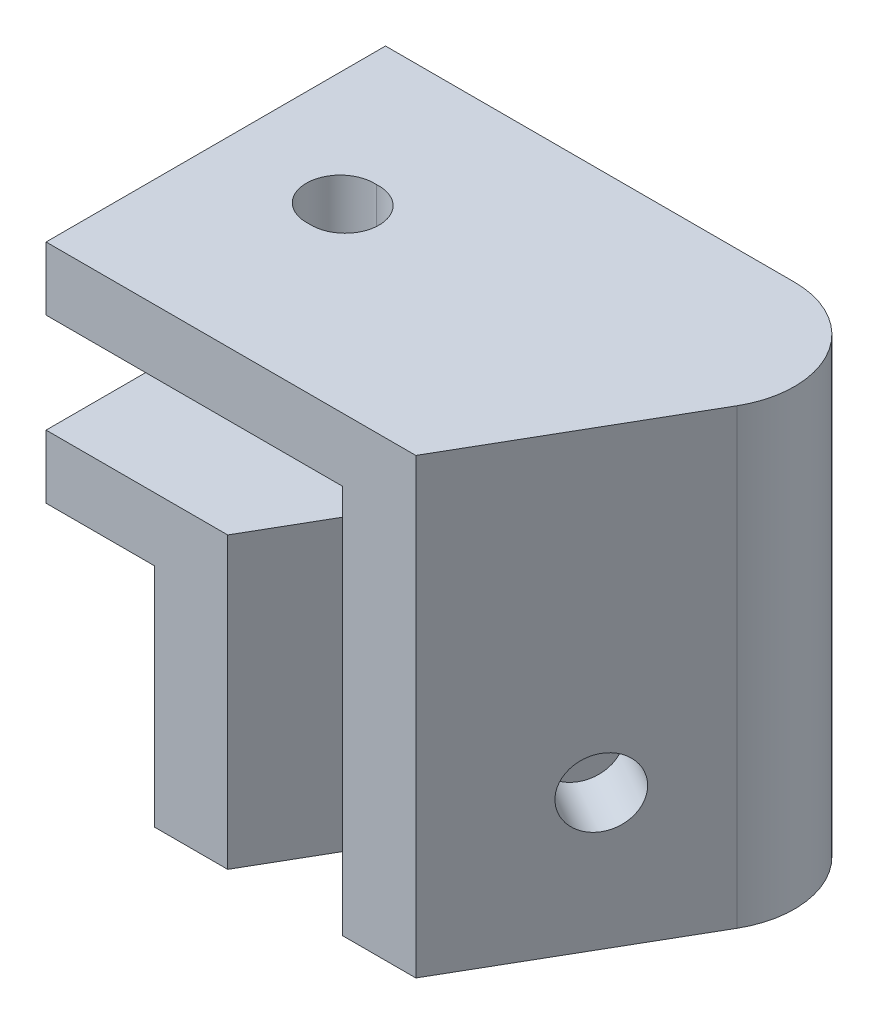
ISO-10303-21;
HEADER;
FILE_DESCRIPTION(('STEP AP214'),'2;1');
FILE_NAME('part.step','',(''),(''),'','','');
FILE_SCHEMA(('AUTOMOTIVE_DESIGN { 1 0 10303 214 1 1 1 1 }'));
ENDSEC;
DATA;
#1=APPLICATION_CONTEXT('core data for automotive mechanical design processes');
#2=APPLICATION_PROTOCOL_DEFINITION('international standard','automotive_design',2000,#1);
#3=PRODUCT_CONTEXT('',#1,'mechanical');
#4=PRODUCT('Part','Part','',(#3));
#5=PRODUCT_RELATED_PRODUCT_CATEGORY('part','',(#4));
#6=PRODUCT_DEFINITION_FORMATION('','',#4);
#7=PRODUCT_DEFINITION_CONTEXT('part definition',#1,'design');
#8=PRODUCT_DEFINITION('design','',#6,#7);
#9=PRODUCT_DEFINITION_SHAPE('','',#8);
#10=(LENGTH_UNIT() NAMED_UNIT(*) SI_UNIT(.MILLI.,.METRE.));
#11=(NAMED_UNIT(*) PLANE_ANGLE_UNIT() SI_UNIT($,.RADIAN.));
#12=(NAMED_UNIT(*) SI_UNIT($,.STERADIAN.) SOLID_ANGLE_UNIT());
#13=UNCERTAINTY_MEASURE_WITH_UNIT(LENGTH_MEASURE(1.E-05),#10,'distance_accuracy_value','');
#14=(GEOMETRIC_REPRESENTATION_CONTEXT(3) GLOBAL_UNCERTAINTY_ASSIGNED_CONTEXT((#13)) GLOBAL_UNIT_ASSIGNED_CONTEXT((#10,
#11,#12)) REPRESENTATION_CONTEXT('',''));
#15=CARTESIAN_POINT('',(0.,0.,0.));
#16=DIRECTION('',(0.,0.,1.));
#17=DIRECTION('',(1.,0.,0.));
#18=AXIS2_PLACEMENT_3D('',#15,#16,#17);
#19=CARTESIAN_POINT('',(7.53478768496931,-3.,-4.5));
#20=DIRECTION('',(0.,0.,-1.));
#21=DIRECTION('',(-1.,0.,0.));
#22=AXIS2_PLACEMENT_3D('',#19,#20,#21);
#23=PLANE('',#22);
#24=DIRECTION('',(1.,0.,0.));
#25=VECTOR('',#24,1.);
#26=CARTESIAN_POINT('',(7.53478768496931,-7.2,-4.5));
#27=LINE('',#26,#25);
#28=CARTESIAN_POINT('',(2.45410531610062,-7.2,-4.5));
#29=VERTEX_POINT('',#28);
#30=CARTESIAN_POINT('',(7.53478768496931,-7.2,-4.5));
#31=VERTEX_POINT('',#30);
#32=EDGE_CURVE('E195',#29,#31,#27,.T.);
#33=ORIENTED_EDGE('',*,*,#32,.T.);
#34=DIRECTION('',(0.,-1.,0.));
#35=VECTOR('',#34,1.);
#36=CARTESIAN_POINT('',(7.53478768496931,-3.,-4.5));
#37=LINE('',#36,#35);
#38=CARTESIAN_POINT('',(7.53478768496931,-2.8,-4.5));
#39=VERTEX_POINT('',#38);
#40=EDGE_CURVE('E230',#39,#31,#37,.T.);
#41=ORIENTED_EDGE('',*,*,#40,.F.);
#42=DIRECTION('',(-1.,0.,0.));
#43=VECTOR('',#42,1.);
#44=CARTESIAN_POINT('',(17.8405543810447,-2.8,-4.5));
#45=LINE('',#44,#43);
#46=CARTESIAN_POINT('',(-12.5,-2.8,-4.5));
#47=VERTEX_POINT('',#46);
#48=EDGE_CURVE('E216',#39,#47,#45,.T.);
#49=ORIENTED_EDGE('',*,*,#48,.T.);
#50=DIRECTION('',(0.,1.,0.));
#51=VECTOR('',#50,1.);
#52=CARTESIAN_POINT('',(-12.5,-7.2,-4.5));
#53=LINE('',#52,#51);
#54=CARTESIAN_POINT('',(-12.5,-7.2,-4.5));
#55=VERTEX_POINT('',#54);
#56=EDGE_CURVE('E209',#55,#47,#53,.T.);
#57=ORIENTED_EDGE('',*,*,#56,.F.);
#58=DIRECTION('',(-1.,0.,0.));
#59=VECTOR('',#58,1.);
#60=CARTESIAN_POINT('',(17.8405543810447,-7.2,-4.5));
#61=LINE('',#60,#59);
#62=EDGE_CURVE('E208',#29,#55,#61,.T.);
#63=ORIENTED_EDGE('',*,*,#62,.F.);
#64=EDGE_LOOP('',(#33,#41,#49,#57,#63));
#65=FACE_BOUND('',#64,.T.);
#66=ADVANCED_FACE('F34',(#65),#23,.F.);
#67=CARTESIAN_POINT('',(-12.5,-10.,7.5));
#68=DIRECTION('',(0.,0.,-1.));
#69=DIRECTION('',(-1.,0.,0.));
#70=AXIS2_PLACEMENT_3D('',#67,#68,#69);
#71=PLANE('',#70);
#72=DIRECTION('',(0.,1.,0.));
#73=VECTOR('',#72,1.);
#74=CARTESIAN_POINT('',(-12.5,-10.,7.5));
#75=LINE('',#74,#73);
#76=CARTESIAN_POINT('',(-12.5,-10.,7.5));
#77=VERTEX_POINT('',#76);
#78=CARTESIAN_POINT('',(-12.5,-7.2,7.5));
#79=VERTEX_POINT('',#78);
#80=EDGE_CURVE('E281',#77,#79,#75,.T.);
#81=ORIENTED_EDGE('',*,*,#80,.F.);
#82=DIRECTION('',(1.,0.,0.));
#83=VECTOR('',#82,1.);
#84=CARTESIAN_POINT('',(-12.5,-10.,7.5));
#85=LINE('',#84,#83);
#86=CARTESIAN_POINT('',(-7.70725942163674,-10.,7.5));
#87=VERTEX_POINT('',#86);
#88=EDGE_CURVE('E270',#77,#87,#85,.T.);
#89=ORIENTED_EDGE('',*,*,#88,.T.);
#90=DIRECTION('',(0.,1.,0.));
#91=VECTOR('',#90,1.);
#92=CARTESIAN_POINT('',(-7.70725942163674,-20.,7.5));
#93=LINE('',#92,#91);
#94=CARTESIAN_POINT('',(-7.70725942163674,-20.,7.5));
#95=VERTEX_POINT('',#94);
#96=EDGE_CURVE('E258',#95,#87,#93,.T.);
#97=ORIENTED_EDGE('',*,*,#96,.F.);
#98=DIRECTION('',(1.,0.,0.));
#99=VECTOR('',#98,1.);
#100=CARTESIAN_POINT('',(3.83974596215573,-20.,7.5));
#101=LINE('',#100,#99);
#102=CARTESIAN_POINT('',(-4.47409791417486,-20.,7.5));
#103=VERTEX_POINT('',#102);
#104=EDGE_CURVE('E248',#95,#103,#101,.T.);
#105=ORIENTED_EDGE('',*,*,#104,.T.);
#106=DIRECTION('',(0.,-1.,0.));
#107=VECTOR('',#106,1.);
#108=CARTESIAN_POINT('',(-4.47409791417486,-10.,7.5));
#109=LINE('',#108,#107);
#110=CARTESIAN_POINT('',(-4.47409791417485,-7.2,7.5));
#111=VERTEX_POINT('',#110);
#112=EDGE_CURVE('E238',#111,#103,#109,.T.);
#113=ORIENTED_EDGE('',*,*,#112,.F.);
#114=DIRECTION('',(-1.,0.,0.));
#115=VECTOR('',#114,1.);
#116=CARTESIAN_POINT('',(17.8405543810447,-7.2,7.5));
#117=LINE('',#116,#115);
#118=EDGE_CURVE('E218',#111,#79,#117,.T.);
#119=ORIENTED_EDGE('',*,*,#118,.T.);
#120=EDGE_LOOP('',(#81,#89,#97,#105,#113,#119));
#121=FACE_BOUND('',#120,.T.);
#122=ADVANCED_FACE('F340',(#121),#71,.F.);
#123=CARTESIAN_POINT('',(0.,-10.,0.));
#124=DIRECTION('',(0.,1.,0.));
#125=DIRECTION('',(0.,0.,-1.));
#126=AXIS2_PLACEMENT_3D('',#123,#124,#125);
#127=PLANE('',#126);
#128=CARTESIAN_POINT('',(-7.50000000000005,-10.,-0.499999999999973));
#129=DIRECTION('',(0.,-1.,0.));
#130=DIRECTION('',(0.,0.,-1.));
#131=AXIS2_PLACEMENT_3D('',#128,#129,#130);
#132=CIRCLE('',#131,1.49999999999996);
#133=CARTESIAN_POINT('',(-7.3931817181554,-10.,0.996191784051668));
#134=VERTEX_POINT('',#133);
#135=CARTESIAN_POINT('',(-7.39318171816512,-10.,-1.99619178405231));
#136=VERTEX_POINT('',#135);
#137=EDGE_CURVE('E188',#134,#136,#132,.T.);
#138=ORIENTED_EDGE('',*,*,#137,.F.);
#139=CARTESIAN_POINT('',(-7.28636343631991,-10.,-0.500000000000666));
#140=DIRECTION('',(0.,1.,0.));
#141=DIRECTION('',(0.,0.,1.));
#142=AXIS2_PLACEMENT_3D('',#139,#140,#141);
#143=CIRCLE('',#142,1.5);
#144=EDGE_CURVE('E57',#134,#136,#143,.T.);
#145=ORIENTED_EDGE('',*,*,#144,.T.);
#146=EDGE_LOOP('',(#138,#145));
#147=FACE_BOUND('',#146,.T.);
#148=DIRECTION('',(-0.499999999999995,0.,0.866025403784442));
#149=VECTOR('',#148,1.);
#150=CARTESIAN_POINT('',(0.952994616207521,-10.,-7.5));
#151=LINE('',#150,#149);
#152=CARTESIAN_POINT('',(0.95299461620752,-10.,-7.5));
#153=VERTEX_POINT('',#152);
#154=EDGE_CURVE('E241',#153,#87,#151,.T.);
#155=ORIENTED_EDGE('',*,*,#154,.T.);
#156=ORIENTED_EDGE('',*,*,#88,.F.);
#157=DIRECTION('',(0.,0.,1.));
#158=VECTOR('',#157,1.);
#159=CARTESIAN_POINT('',(-12.5,-10.,7.5));
#160=LINE('',#159,#158);
#161=CARTESIAN_POINT('',(-12.5,-10.,-7.5));
#162=VERTEX_POINT('',#161);
#163=EDGE_CURVE('E267',#162,#77,#160,.T.);
#164=ORIENTED_EDGE('',*,*,#163,.F.);
#165=DIRECTION('',(-1.,0.,0.));
#166=VECTOR('',#165,1.);
#167=CARTESIAN_POINT('',(-12.5,-10.,-7.5));
#168=LINE('',#167,#166);
#169=EDGE_CURVE('E264',#153,#162,#168,.T.);
#170=ORIENTED_EDGE('',*,*,#169,.F.);
#171=EDGE_LOOP('',(#155,#156,#164,#170));
#172=FACE_BOUND('',#171,.T.);
#173=ADVANCED_FACE('F311',(#147,#172),#127,.F.);
#174=CARTESIAN_POINT('',(-12.5,-10.,-7.5));
#175=DIRECTION('',(0.,0.,1.));
#176=DIRECTION('',(1.,0.,0.));
#177=AXIS2_PLACEMENT_3D('',#174,#175,#176);
#178=PLANE('',#177);
#179=DIRECTION('',(-1.,0.,0.));
#180=VECTOR('',#179,1.);
#181=CARTESIAN_POINT('',(0.952994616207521,-20.,-7.5));
#182=LINE('',#181,#180);
#183=CARTESIAN_POINT('',(5.57179676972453,-20.,-7.5));
#184=VERTEX_POINT('',#183);
#185=CARTESIAN_POINT('',(0.952994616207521,-20.,-7.5));
#186=VERTEX_POINT('',#185);
#187=EDGE_CURVE('E242',#184,#186,#182,.T.);
#188=ORIENTED_EDGE('',*,*,#187,.T.);
#189=DIRECTION('',(0.,1.,0.));
#190=VECTOR('',#189,1.);
#191=CARTESIAN_POINT('',(0.952994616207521,-20.,-7.5));
#192=LINE('',#191,#190);
#193=EDGE_CURVE('E261',#186,#153,#192,.T.);
#194=ORIENTED_EDGE('',*,*,#193,.T.);
#195=ORIENTED_EDGE('',*,*,#169,.T.);
#196=DIRECTION('',(0.,1.,0.));
#197=VECTOR('',#196,1.);
#198=CARTESIAN_POINT('',(-12.5,-10.,-7.5));
#199=LINE('',#198,#197);
#200=CARTESIAN_POINT('',(-12.5,0.,-7.5));
#201=VERTEX_POINT('',#200);
#202=EDGE_CURVE('E284',#162,#201,#199,.T.);
#203=ORIENTED_EDGE('',*,*,#202,.T.);
#204=DIRECTION('',(-1.,0.,0.));
#205=VECTOR('',#204,1.);
#206=CARTESIAN_POINT('',(-12.5,0.,-7.5));
#207=LINE('',#206,#205);
#208=CARTESIAN_POINT('',(5.57179676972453,0.,-7.5));
#209=VERTEX_POINT('',#208);
#210=EDGE_CURVE('E263',#209,#201,#207,.T.);
#211=ORIENTED_EDGE('',*,*,#210,.F.);
#212=DIRECTION('',(0.,1.,0.));
#213=VECTOR('',#212,1.);
#214=CARTESIAN_POINT('',(5.57179676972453,-10.,-7.5));
#215=LINE('',#214,#213);
#216=EDGE_CURVE('E292',#184,#209,#215,.T.);
#217=ORIENTED_EDGE('',*,*,#216,.F.);
#218=EDGE_LOOP('',(#188,#194,#195,#203,#211,#217));
#219=FACE_BOUND('',#218,.T.);
#220=ADVANCED_FACE('F375',(#219),#178,.F.);
#221=CARTESIAN_POINT('',(-12.5,-10.,7.5));
#222=DIRECTION('',(1.,0.,0.));
#223=DIRECTION('',(0.,0.,-1.));
#224=AXIS2_PLACEMENT_3D('',#221,#222,#223);
#225=PLANE('',#224);
#226=ORIENTED_EDGE('',*,*,#56,.T.);
#227=DIRECTION('',(0.,0.,1.));
#228=VECTOR('',#227,1.);
#229=CARTESIAN_POINT('',(-12.5,-2.8,7.5));
#230=LINE('',#229,#228);
#231=CARTESIAN_POINT('',(-12.5,-2.8,7.5));
#232=VERTEX_POINT('',#231);
#233=EDGE_CURVE('E205',#47,#232,#230,.T.);
#234=ORIENTED_EDGE('',*,*,#233,.T.);
#235=CARTESIAN_POINT('',(-12.5,0.,7.5));
#236=VERTEX_POINT('',#235);
#237=EDGE_CURVE('E273',#232,#236,#75,.T.);
#238=ORIENTED_EDGE('',*,*,#237,.T.);
#239=DIRECTION('',(0.,0.,1.));
#240=VECTOR('',#239,1.);
#241=CARTESIAN_POINT('',(-12.5,0.,7.5));
#242=LINE('',#241,#240);
#243=EDGE_CURVE('E276',#201,#236,#242,.T.);
#244=ORIENTED_EDGE('',*,*,#243,.F.);
#245=ORIENTED_EDGE('',*,*,#202,.F.);
#246=ORIENTED_EDGE('',*,*,#163,.T.);
#247=ORIENTED_EDGE('',*,*,#80,.T.);
#248=DIRECTION('',(0.,0.,-1.));
#249=VECTOR('',#248,1.);
#250=CARTESIAN_POINT('',(-12.5,-7.2,7.5));
#251=LINE('',#250,#249);
#252=EDGE_CURVE('E204',#79,#55,#251,.T.);
#253=ORIENTED_EDGE('',*,*,#252,.T.);
#254=EDGE_LOOP('',(#226,#234,#238,#244,#245,#246,#247,#253));
#255=FACE_BOUND('',#254,.T.);
#256=ADVANCED_FACE('F365',(#255),#225,.F.);
#257=DIRECTION('',(0.,1.,0.));
#258=VECTOR('',#257,1.);
#259=CARTESIAN_POINT('',(0.606584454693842,-10.,7.5));
#260=LINE('',#259,#258);
#261=CARTESIAN_POINT('',(0.606584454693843,-20.,7.5));
#262=VERTEX_POINT('',#261);
#263=CARTESIAN_POINT('',(0.606584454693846,-2.8,7.5));
#264=VERTEX_POINT('',#263);
#265=EDGE_CURVE('E233',#262,#264,#260,.T.);
#266=ORIENTED_EDGE('',*,*,#265,.F.);
#267=CARTESIAN_POINT('',(3.83974596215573,-20.,7.5));
#268=VERTEX_POINT('',#267);
#269=EDGE_CURVE('E247',#262,#268,#101,.T.);
#270=ORIENTED_EDGE('',*,*,#269,.T.);
#271=DIRECTION('',(0.,1.,0.));
#272=VECTOR('',#271,1.);
#273=CARTESIAN_POINT('',(3.83974596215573,-20.,7.5));
#274=LINE('',#273,#272);
#275=CARTESIAN_POINT('',(3.83974596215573,0.,7.5));
#276=VERTEX_POINT('',#275);
#277=EDGE_CURVE('E254',#268,#276,#274,.T.);
#278=ORIENTED_EDGE('',*,*,#277,.T.);
#279=DIRECTION('',(1.,0.,0.));
#280=VECTOR('',#279,1.);
#281=CARTESIAN_POINT('',(-12.5,0.,7.5));
#282=LINE('',#281,#280);
#283=EDGE_CURVE('E268',#236,#276,#282,.T.);
#284=ORIENTED_EDGE('',*,*,#283,.F.);
#285=ORIENTED_EDGE('',*,*,#237,.F.);
#286=DIRECTION('',(-1.,0.,0.));
#287=VECTOR('',#286,1.);
#288=CARTESIAN_POINT('',(17.8405543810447,-2.8,7.5));
#289=LINE('',#288,#287);
#290=EDGE_CURVE('E215',#264,#232,#289,.T.);
#291=ORIENTED_EDGE('',*,*,#290,.F.);
#292=EDGE_LOOP('',(#266,#270,#278,#284,#285,#291));
#293=FACE_BOUND('',#292,.T.);
#294=ADVANCED_FACE('F384',(#293),#71,.F.);
#295=CARTESIAN_POINT('',(0.,0.,0.));
#296=DIRECTION('',(0.,1.,0.));
#297=DIRECTION('',(0.,0.,-1.));
#298=AXIS2_PLACEMENT_3D('',#295,#296,#297);
#299=PLANE('',#298);
#300=CARTESIAN_POINT('',(-7.28636343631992,0.,-0.500000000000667));
#301=DIRECTION('',(0.,1.,0.));
#302=DIRECTION('',(1.,0.,0.));
#303=AXIS2_PLACEMENT_3D('',#300,#301,#302);
#304=CIRCLE('',#303,1.5);
#305=CARTESIAN_POINT('',(-7.3931817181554,0.,0.996191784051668));
#306=VERTEX_POINT('',#305);
#307=CARTESIAN_POINT('',(-7.39318171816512,0.,-1.99619178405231));
#308=VERTEX_POINT('',#307);
#309=EDGE_CURVE('E157',#306,#308,#304,.T.);
#310=ORIENTED_EDGE('',*,*,#309,.F.);
#311=CARTESIAN_POINT('',(-7.50000000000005,0.,-0.499999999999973));
#312=DIRECTION('',(0.,-1.,0.));
#313=DIRECTION('',(0.,0.,-1.));
#314=AXIS2_PLACEMENT_3D('',#311,#312,#313);
#315=CIRCLE('',#314,1.49999999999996);
#316=EDGE_CURVE('E170',#306,#308,#315,.T.);
#317=ORIENTED_EDGE('',*,*,#316,.T.);
#318=EDGE_LOOP('',(#310,#317));
#319=FACE_BOUND('',#318,.T.);
#320=ORIENTED_EDGE('',*,*,#210,.T.);
#321=ORIENTED_EDGE('',*,*,#243,.T.);
#322=ORIENTED_EDGE('',*,*,#283,.T.);
#323=DIRECTION('',(0.499999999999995,0.,-0.866025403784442));
#324=VECTOR('',#323,1.);
#325=CARTESIAN_POINT('',(6.12740473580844,0.,3.53765877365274));
#326=LINE('',#325,#324);
#327=CARTESIAN_POINT('',(9.0358983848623,0.,-1.50000000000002));
#328=VERTEX_POINT('',#327);
#329=EDGE_CURVE('E287',#276,#328,#326,.T.);
#330=ORIENTED_EDGE('',*,*,#329,.T.);
#331=CARTESIAN_POINT('',(5.57179676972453,0.,-3.5));
#332=DIRECTION('',(0.,-1.,0.));
#333=DIRECTION('',(0.,0.,-1.));
#334=AXIS2_PLACEMENT_3D('',#331,#332,#333);
#335=CIRCLE('',#334,4.);
#336=EDGE_CURVE('E295',#209,#328,#335,.T.);
#337=ORIENTED_EDGE('',*,*,#336,.F.);
#338=EDGE_LOOP('',(#320,#321,#322,#330,#337));
#339=FACE_BOUND('',#338,.T.);
#340=ADVANCED_FACE('F175',(#319,#339),#299,.T.);
#341=CARTESIAN_POINT('',(0.952994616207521,-20.,-7.5));
#342=DIRECTION('',(0.866025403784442,0.,0.499999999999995));
#343=DIRECTION('',(0.499999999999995,0.,-0.866025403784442));
#344=AXIS2_PLACEMENT_3D('',#341,#342,#343);
#345=PLANE('',#344);
#346=CARTESIAN_POINT('',(-1.8205080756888,-14.,-2.69615242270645));
#347=DIRECTION('',(-0.866025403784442,0.,-0.499999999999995));
#348=DIRECTION('',(0.499999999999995,0.,-0.866025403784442));
#349=AXIS2_PLACEMENT_3D('',#346,#347,#348);
#350=CIRCLE('',#349,1.5);
#351=CARTESIAN_POINT('',(-1.07050807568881,-14.,-3.99519052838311));
#352=VERTEX_POINT('',#351);
#353=EDGE_CURVE('E177',#352,#352,#350,.T.);
#354=ORIENTED_EDGE('',*,*,#353,.F.);
#355=EDGE_LOOP('',(#354));
#356=FACE_BOUND('',#355,.T.);
#357=ORIENTED_EDGE('',*,*,#154,.F.);
#358=ORIENTED_EDGE('',*,*,#193,.F.);
#359=DIRECTION('',(-0.499999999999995,0.,0.866025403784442));
#360=VECTOR('',#359,1.);
#361=CARTESIAN_POINT('',(0.952994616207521,-20.,-7.5));
#362=LINE('',#361,#360);
#363=EDGE_CURVE('E245',#186,#95,#362,.T.);
#364=ORIENTED_EDGE('',*,*,#363,.T.);
#365=ORIENTED_EDGE('',*,*,#96,.T.);
#366=EDGE_LOOP('',(#357,#358,#364,#365));
#367=FACE_BOUND('',#366,.T.);
#368=ADVANCED_FACE('F372',(#356,#367),#345,.F.);
#369=CARTESIAN_POINT('',(12.5,-20.,-7.5));
#370=DIRECTION('',(-0.866025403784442,0.,-0.499999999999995));
#371=DIRECTION('',(-0.499999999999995,0.,0.866025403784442));
#372=AXIS2_PLACEMENT_3D('',#369,#370,#371);
#373=PLANE('',#372);
#374=CARTESIAN_POINT('',(6.83974596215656,-14.,2.30384757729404));
#375=DIRECTION('',(-0.866025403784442,0.,-0.499999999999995));
#376=DIRECTION('',(0.499999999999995,0.,-0.866025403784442));
#377=AXIS2_PLACEMENT_3D('',#374,#375,#376);
#378=CIRCLE('',#377,1.5);
#379=CARTESIAN_POINT('',(7.58974596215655,-14.,1.00480947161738));
#380=VERTEX_POINT('',#379);
#381=EDGE_CURVE('E173',#380,#380,#378,.T.);
#382=ORIENTED_EDGE('',*,*,#381,.T.);
#383=EDGE_LOOP('',(#382));
#384=FACE_BOUND('',#383,.T.);
#385=ORIENTED_EDGE('',*,*,#329,.F.);
#386=ORIENTED_EDGE('',*,*,#277,.F.);
#387=DIRECTION('',(0.499999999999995,0.,-0.866025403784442));
#388=VECTOR('',#387,1.);
#389=CARTESIAN_POINT('',(12.5,-20.,-7.5));
#390=LINE('',#389,#388);
#391=CARTESIAN_POINT('',(9.0358983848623,-20.,-1.50000000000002));
#392=VERTEX_POINT('',#391);
#393=EDGE_CURVE('E251',#268,#392,#390,.T.);
#394=ORIENTED_EDGE('',*,*,#393,.T.);
#395=DIRECTION('',(0.,1.,0.));
#396=VECTOR('',#395,1.);
#397=CARTESIAN_POINT('',(9.0358983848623,-20.,-1.50000000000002));
#398=LINE('',#397,#396);
#399=EDGE_CURVE('E298',#328,#392,#398,.F.);
#400=ORIENTED_EDGE('',*,*,#399,.F.);
#401=EDGE_LOOP('',(#385,#386,#394,#400));
#402=FACE_BOUND('',#401,.T.);
#403=ADVANCED_FACE('F380',(#384,#402),#373,.F.);
#404=CARTESIAN_POINT('',(0.,-20.,0.));
#405=DIRECTION('',(0.,1.,0.));
#406=DIRECTION('',(0.,0.,-1.));
#407=AXIS2_PLACEMENT_3D('',#404,#405,#406);
#408=PLANE('',#407);
#409=ORIENTED_EDGE('',*,*,#393,.F.);
#410=ORIENTED_EDGE('',*,*,#269,.F.);
#411=DIRECTION('',(-0.499999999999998,0.,0.86602540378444));
#412=VECTOR('',#411,1.);
#413=CARTESIAN_POINT('',(3.70253360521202,-20.,2.13765877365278));
#414=LINE('',#413,#412);
#415=CARTESIAN_POINT('',(6.26461709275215,-20.,-2.30000000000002));
#416=VERTEX_POINT('',#415);
#417=EDGE_CURVE('E290',#416,#262,#414,.T.);
#418=ORIENTED_EDGE('',*,*,#417,.F.);
#419=DIRECTION('',(0.86602540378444,0.,0.499999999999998));
#420=VECTOR('',#419,1.);
#421=CARTESIAN_POINT('',(2.45410531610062,-20.,-4.50000000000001));
#422=LINE('',#421,#420);
#423=CARTESIAN_POINT('',(2.45410531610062,-20.,-4.50000000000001));
#424=VERTEX_POINT('',#423);
#425=EDGE_CURVE('E191',#424,#416,#422,.T.);
#426=ORIENTED_EDGE('',*,*,#425,.F.);
#427=DIRECTION('',(-0.499999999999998,0.,0.86602540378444));
#428=VECTOR('',#427,1.);
#429=CARTESIAN_POINT('',(-4.97346772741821,-20.,8.36493388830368));
#430=LINE('',#429,#428);
#431=EDGE_CURVE('E228',#424,#103,#430,.T.);
#432=ORIENTED_EDGE('',*,*,#431,.T.);
#433=ORIENTED_EDGE('',*,*,#104,.F.);
#434=ORIENTED_EDGE('',*,*,#363,.F.);
#435=ORIENTED_EDGE('',*,*,#187,.F.);
#436=CARTESIAN_POINT('',(5.57179676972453,-20.,-3.5));
#437=DIRECTION('',(0.,-1.,0.));
#438=DIRECTION('',(0.,0.,-1.));
#439=AXIS2_PLACEMENT_3D('',#436,#437,#438);
#440=CIRCLE('',#439,4.);
#441=EDGE_CURVE('E301',#392,#184,#440,.F.);
#442=ORIENTED_EDGE('',*,*,#441,.F.);
#443=EDGE_LOOP('',(#409,#410,#418,#426,#432,#433,#434,#435,#442));
#444=FACE_BOUND('',#443,.T.);
#445=ADVANCED_FACE('F329',(#444),#408,.F.);
#446=CARTESIAN_POINT('',(-4.97346772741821,-3.,8.36493388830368));
#447=DIRECTION('',(-0.86602540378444,0.,-0.499999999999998));
#448=DIRECTION('',(-0.499999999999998,0.,0.86602540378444));
#449=AXIS2_PLACEMENT_3D('',#446,#447,#448);
#450=PLANE('',#449);
#451=CARTESIAN_POINT('',(0.60436305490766,-14.,-1.29615242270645));
#452=DIRECTION('',(0.86602540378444,0.,0.499999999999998));
#453=DIRECTION('',(-0.499999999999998,0.,0.86602540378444));
#454=AXIS2_PLACEMENT_3D('',#451,#452,#453);
#455=CIRCLE('',#454,1.5);
#456=CARTESIAN_POINT('',(-0.145636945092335,-14.,0.00288568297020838));
#457=VERTEX_POINT('',#456);
#458=EDGE_CURVE('E182',#457,#457,#455,.T.);
#459=ORIENTED_EDGE('',*,*,#458,.F.);
#460=EDGE_LOOP('',(#459));
#461=FACE_BOUND('',#460,.T.);
#462=ORIENTED_EDGE('',*,*,#112,.T.);
#463=ORIENTED_EDGE('',*,*,#431,.F.);
#464=DIRECTION('',(0.,-1.,0.));
#465=VECTOR('',#464,1.);
#466=CARTESIAN_POINT('',(2.45410531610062,-3.,-4.50000000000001));
#467=LINE('',#466,#465);
#468=EDGE_CURVE('E231',#29,#424,#467,.T.);
#469=ORIENTED_EDGE('',*,*,#468,.F.);
#470=DIRECTION('',(0.499999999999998,0.,-0.86602540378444));
#471=VECTOR('',#470,1.);
#472=CARTESIAN_POINT('',(-4.97346772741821,-7.2,8.36493388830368));
#473=LINE('',#472,#471);
#474=EDGE_CURVE('E225',#111,#29,#473,.T.);
#475=ORIENTED_EDGE('',*,*,#474,.F.);
#476=EDGE_LOOP('',(#462,#463,#469,#475));
#477=FACE_BOUND('',#476,.T.);
#478=ADVANCED_FACE('F325',(#461,#477),#450,.F.);
#479=CARTESIAN_POINT('',(-0.0285008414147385,-3.,8.6));
#480=DIRECTION('',(0.86602540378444,0.,0.499999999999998));
#481=DIRECTION('',(0.499999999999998,0.,-0.86602540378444));
#482=AXIS2_PLACEMENT_3D('',#479,#480,#481);
#483=PLANE('',#482);
#484=CARTESIAN_POINT('',(4.4148748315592,-14.,0.903847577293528));
#485=DIRECTION('',(-0.86602540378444,0.,-0.499999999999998));
#486=DIRECTION('',(0.499999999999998,0.,-0.86602540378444));
#487=AXIS2_PLACEMENT_3D('',#484,#485,#486);
#488=CIRCLE('',#487,1.5);
#489=CARTESIAN_POINT('',(5.1648748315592,-14.,-0.395190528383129));
#490=VERTEX_POINT('',#489);
#491=EDGE_CURVE('E303',#490,#490,#488,.T.);
#492=ORIENTED_EDGE('',*,*,#491,.F.);
#493=EDGE_LOOP('',(#492));
#494=FACE_BOUND('',#493,.T.);
#495=ORIENTED_EDGE('',*,*,#417,.T.);
#496=ORIENTED_EDGE('',*,*,#265,.T.);
#497=DIRECTION('',(-0.499999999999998,0.,0.86602540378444));
#498=VECTOR('',#497,1.);
#499=CARTESIAN_POINT('',(4.91507693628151,-2.8,0.0374721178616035));
#500=LINE('',#499,#498);
#501=EDGE_CURVE('E213',#39,#264,#500,.T.);
#502=ORIENTED_EDGE('',*,*,#501,.F.);
#503=ORIENTED_EDGE('',*,*,#40,.T.);
#504=DIRECTION('',(-0.499999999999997,0.,0.86602540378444));
#505=VECTOR('',#504,1.);
#506=CARTESIAN_POINT('',(6.26461709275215,-7.2,-2.30000000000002));
#507=LINE('',#506,#505);
#508=CARTESIAN_POINT('',(6.26461709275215,-7.2,-2.30000000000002));
#509=VERTEX_POINT('',#508);
#510=EDGE_CURVE('E192',#31,#509,#507,.T.);
#511=ORIENTED_EDGE('',*,*,#510,.T.);
#512=DIRECTION('',(0.,-1.,0.));
#513=VECTOR('',#512,1.);
#514=CARTESIAN_POINT('',(6.26461709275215,-1.66345474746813,-2.30000000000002));
#515=LINE('',#514,#513);
#516=EDGE_CURVE('E196',#509,#416,#515,.T.);
#517=ORIENTED_EDGE('',*,*,#516,.T.);
#518=EDGE_LOOP('',(#495,#496,#502,#503,#511,#517));
#519=FACE_BOUND('',#518,.T.);
#520=ADVANCED_FACE('F328',(#494,#519),#483,.F.);
#521=CARTESIAN_POINT('',(17.8405543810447,-7.2,7.5));
#522=DIRECTION('',(0.,-1.,0.));
#523=DIRECTION('',(0.,0.,1.));
#524=AXIS2_PLACEMENT_3D('',#521,#522,#523);
#525=PLANE('',#524);
#526=CARTESIAN_POINT('',(-7.50000000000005,-7.2,-0.499999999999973));
#527=DIRECTION('',(0.,1.,0.));
#528=DIRECTION('',(0.,0.,1.));
#529=AXIS2_PLACEMENT_3D('',#526,#527,#528);
#530=CIRCLE('',#529,1.49999999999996);
#531=CARTESIAN_POINT('',(-7.39318171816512,-7.2,-1.99619178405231));
#532=VERTEX_POINT('',#531);
#533=CARTESIAN_POINT('',(-7.3931817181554,-7.2,0.996191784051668));
#534=VERTEX_POINT('',#533);
#535=EDGE_CURVE('E179',#532,#534,#530,.T.);
#536=ORIENTED_EDGE('',*,*,#535,.F.);
#537=CARTESIAN_POINT('',(-7.28636343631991,-7.2,-0.500000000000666));
#538=DIRECTION('',(0.,-1.,0.));
#539=DIRECTION('',(0.,0.,-1.));
#540=AXIS2_PLACEMENT_3D('',#537,#538,#539);
#541=CIRCLE('',#540,1.5);
#542=EDGE_CURVE('E165',#532,#534,#541,.T.);
#543=ORIENTED_EDGE('',*,*,#542,.T.);
#544=EDGE_LOOP('',(#536,#543));
#545=FACE_BOUND('',#544,.T.);
#546=ORIENTED_EDGE('',*,*,#118,.F.);
#547=ORIENTED_EDGE('',*,*,#474,.T.);
#548=ORIENTED_EDGE('',*,*,#62,.T.);
#549=ORIENTED_EDGE('',*,*,#252,.F.);
#550=EDGE_LOOP('',(#546,#547,#548,#549));
#551=FACE_BOUND('',#550,.T.);
#552=ADVANCED_FACE('F366',(#545,#551),#525,.F.);
#553=CARTESIAN_POINT('',(17.8405543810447,-2.8,7.5));
#554=DIRECTION('',(0.,1.,0.));
#555=DIRECTION('',(0.,0.,-1.));
#556=AXIS2_PLACEMENT_3D('',#553,#554,#555);
#557=PLANE('',#556);
#558=CARTESIAN_POINT('',(-7.50000000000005,-2.8,-0.499999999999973));
#559=DIRECTION('',(0.,-1.,0.));
#560=DIRECTION('',(0.,0.,-1.));
#561=AXIS2_PLACEMENT_3D('',#558,#559,#560);
#562=CIRCLE('',#561,1.49999999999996);
#563=CARTESIAN_POINT('',(-7.3931817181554,-2.8,0.996191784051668));
#564=VERTEX_POINT('',#563);
#565=CARTESIAN_POINT('',(-7.39318171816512,-2.8,-1.99619178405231));
#566=VERTEX_POINT('',#565);
#567=EDGE_CURVE('E172',#564,#566,#562,.T.);
#568=ORIENTED_EDGE('',*,*,#567,.F.);
#569=CARTESIAN_POINT('',(-7.28636343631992,-2.8,-0.500000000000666));
#570=DIRECTION('',(0.,1.,0.));
#571=DIRECTION('',(0.,0.,1.));
#572=AXIS2_PLACEMENT_3D('',#569,#570,#571);
#573=CIRCLE('',#572,1.5);
#574=EDGE_CURVE('E49',#564,#566,#573,.T.);
#575=ORIENTED_EDGE('',*,*,#574,.T.);
#576=EDGE_LOOP('',(#568,#575));
#577=FACE_BOUND('',#576,.T.);
#578=ORIENTED_EDGE('',*,*,#48,.F.);
#579=ORIENTED_EDGE('',*,*,#501,.T.);
#580=ORIENTED_EDGE('',*,*,#290,.T.);
#581=ORIENTED_EDGE('',*,*,#233,.F.);
#582=EDGE_LOOP('',(#578,#579,#580,#581));
#583=FACE_BOUND('',#582,.T.);
#584=ADVANCED_FACE('F360',(#577,#583),#557,.F.);
#585=CARTESIAN_POINT('',(2.45410531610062,-1.66345474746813,-4.50000000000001));
#586=DIRECTION('',(-0.499999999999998,0.,0.86602540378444));
#587=DIRECTION('',(0.86602540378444,0.,0.499999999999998));
#588=AXIS2_PLACEMENT_3D('',#585,#586,#587);
#589=PLANE('',#588);
#590=DIRECTION('',(-0.86602540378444,0.,-0.499999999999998));
#591=VECTOR('',#590,1.);
#592=CARTESIAN_POINT('',(2.45410531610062,-7.2,-4.50000000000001));
#593=LINE('',#592,#591);
#594=EDGE_CURVE('E199',#509,#29,#593,.T.);
#595=ORIENTED_EDGE('',*,*,#594,.T.);
#596=ORIENTED_EDGE('',*,*,#468,.T.);
#597=ORIENTED_EDGE('',*,*,#425,.T.);
#598=ORIENTED_EDGE('',*,*,#516,.F.);
#599=EDGE_LOOP('',(#595,#596,#597,#598));
#600=FACE_BOUND('',#599,.T.);
#601=ADVANCED_FACE('F348',(#600),#589,.T.);
#602=CARTESIAN_POINT('',(17.8405543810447,-7.2,7.5));
#603=DIRECTION('',(0.,-1.,0.));
#604=DIRECTION('',(0.,0.,1.));
#605=AXIS2_PLACEMENT_3D('',#602,#603,#604);
#606=PLANE('',#605);
#607=ORIENTED_EDGE('',*,*,#32,.F.);
#608=ORIENTED_EDGE('',*,*,#594,.F.);
#609=ORIENTED_EDGE('',*,*,#510,.F.);
#610=EDGE_LOOP('',(#607,#608,#609));
#611=FACE_BOUND('',#610,.T.);
#612=ADVANCED_FACE('F356',(#611),#606,.F.);
#613=CARTESIAN_POINT('',(5.57179676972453,-10.,-3.5));
#614=DIRECTION('',(0.,1.,0.));
#615=DIRECTION('',(0.,0.,-1.));
#616=AXIS2_PLACEMENT_3D('',#613,#614,#615);
#617=CYLINDRICAL_SURFACE('',#616,4.);
#618=ORIENTED_EDGE('',*,*,#441,.T.);
#619=ORIENTED_EDGE('',*,*,#216,.T.);
#620=ORIENTED_EDGE('',*,*,#336,.T.);
#621=ORIENTED_EDGE('',*,*,#399,.T.);
#622=EDGE_LOOP('',(#618,#619,#620,#621));
#623=FACE_BOUND('',#622,.T.);
#624=ADVANCED_FACE('F36',(#623),#617,.T.);
#625=CARTESIAN_POINT('',(-7.50000000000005,-20.,-0.499999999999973));
#626=DIRECTION('',(0.,1.,0.));
#627=DIRECTION('',(0.,0.,-1.));
#628=AXIS2_PLACEMENT_3D('',#625,#626,#627);
#629=CYLINDRICAL_SURFACE('',#628,1.49999999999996);
#630=ORIENTED_EDGE('',*,*,#567,.T.);
#631=DIRECTION('',(0.,1.,0.));
#632=VECTOR('',#631,1.);
#633=CARTESIAN_POINT('',(-7.39318171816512,-10.0000000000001,-1.99619178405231));
#634=LINE('',#633,#632);
#635=EDGE_CURVE('E160',#566,#308,#634,.T.);
#636=ORIENTED_EDGE('',*,*,#635,.T.);
#637=ORIENTED_EDGE('',*,*,#316,.F.);
#638=DIRECTION('',(0.,1.,0.));
#639=VECTOR('',#638,1.);
#640=CARTESIAN_POINT('',(-7.3931817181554,-10.0000000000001,0.996191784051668));
#641=LINE('',#640,#639);
#642=EDGE_CURVE('E161',#306,#564,#641,.F.);
#643=ORIENTED_EDGE('',*,*,#642,.T.);
#644=EDGE_LOOP('',(#630,#636,#637,#643));
#645=FACE_BOUND('',#644,.T.);
#646=ADVANCED_FACE('F169',(#645),#629,.F.);
#647=ORIENTED_EDGE('',*,*,#137,.T.);
#648=DIRECTION('',(0.,1.,0.));
#649=VECTOR('',#648,1.);
#650=CARTESIAN_POINT('',(-7.39318171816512,-10.0000000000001,-1.99619178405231));
#651=LINE('',#650,#649);
#652=EDGE_CURVE('E11',#136,#532,#651,.T.);
#653=ORIENTED_EDGE('',*,*,#652,.T.);
#654=ORIENTED_EDGE('',*,*,#535,.T.);
#655=DIRECTION('',(0.,1.,0.));
#656=VECTOR('',#655,1.);
#657=CARTESIAN_POINT('',(-7.3931817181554,-10.0000000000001,0.996191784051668));
#658=LINE('',#657,#656);
#659=EDGE_CURVE('E42',#534,#134,#658,.F.);
#660=ORIENTED_EDGE('',*,*,#659,.T.);
#661=EDGE_LOOP('',(#647,#653,#654,#660));
#662=FACE_BOUND('',#661,.T.);
#663=ADVANCED_FACE('F307',(#662),#629,.F.);
#664=CARTESIAN_POINT('',(-10.4807621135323,-14.,-7.69615242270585));
#665=DIRECTION('',(0.866025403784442,0.,0.499999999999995));
#666=DIRECTION('',(0.499999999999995,0.,-0.866025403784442));
#667=AXIS2_PLACEMENT_3D('',#664,#665,#666);
#668=CYLINDRICAL_SURFACE('',#667,1.5);
#669=ORIENTED_EDGE('',*,*,#381,.F.);
#670=EDGE_LOOP('',(#669));
#671=FACE_BOUND('',#670,.T.);
#672=ORIENTED_EDGE('',*,*,#491,.T.);
#673=EDGE_LOOP('',(#672));
#674=FACE_BOUND('',#673,.T.);
#675=ADVANCED_FACE('F492',(#671,#674),#668,.F.);
#676=ORIENTED_EDGE('',*,*,#458,.T.);
#677=EDGE_LOOP('',(#676));
#678=FACE_BOUND('',#677,.T.);
#679=ORIENTED_EDGE('',*,*,#353,.T.);
#680=EDGE_LOOP('',(#679));
#681=FACE_BOUND('',#680,.T.);
#682=ADVANCED_FACE('F322',(#678,#681),#668,.F.);
#683=CARTESIAN_POINT('',(-7.28636343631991,-20.0000000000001,-0.500000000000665));
#684=DIRECTION('',(0.,1.,0.));
#685=DIRECTION('',(-1.,0.,0.));
#686=AXIS2_PLACEMENT_3D('',#683,#684,#685);
#687=CYLINDRICAL_SURFACE('',#686,1.5);
#688=ORIENTED_EDGE('',*,*,#144,.F.);
#689=ORIENTED_EDGE('',*,*,#659,.F.);
#690=ORIENTED_EDGE('',*,*,#542,.F.);
#691=ORIENTED_EDGE('',*,*,#652,.F.);
#692=EDGE_LOOP('',(#688,#689,#690,#691));
#693=FACE_BOUND('',#692,.T.);
#694=ADVANCED_FACE('F507',(#693),#687,.F.);
#695=ORIENTED_EDGE('',*,*,#574,.F.);
#696=ORIENTED_EDGE('',*,*,#642,.F.);
#697=ORIENTED_EDGE('',*,*,#309,.T.);
#698=ORIENTED_EDGE('',*,*,#635,.F.);
#699=EDGE_LOOP('',(#695,#696,#697,#698));
#700=FACE_BOUND('',#699,.T.);
#701=ADVANCED_FACE('F159',(#700),#687,.F.);
#702=CLOSED_SHELL('',(#66,#122,#173,#220,#256,#294,#340,#368,#403,#445,#478,#520,#552,#584,#601,
#612,#624,#646,#663,#675,#682,#694,#701));
#703=MANIFOLD_SOLID_BREP('B2',#702);
#704=ADVANCED_BREP_SHAPE_REPRESENTATION('',(#18,#703),#14);
#705=SHAPE_DEFINITION_REPRESENTATION(#9,#704);
ENDSEC;
END-ISO-10303-21;
